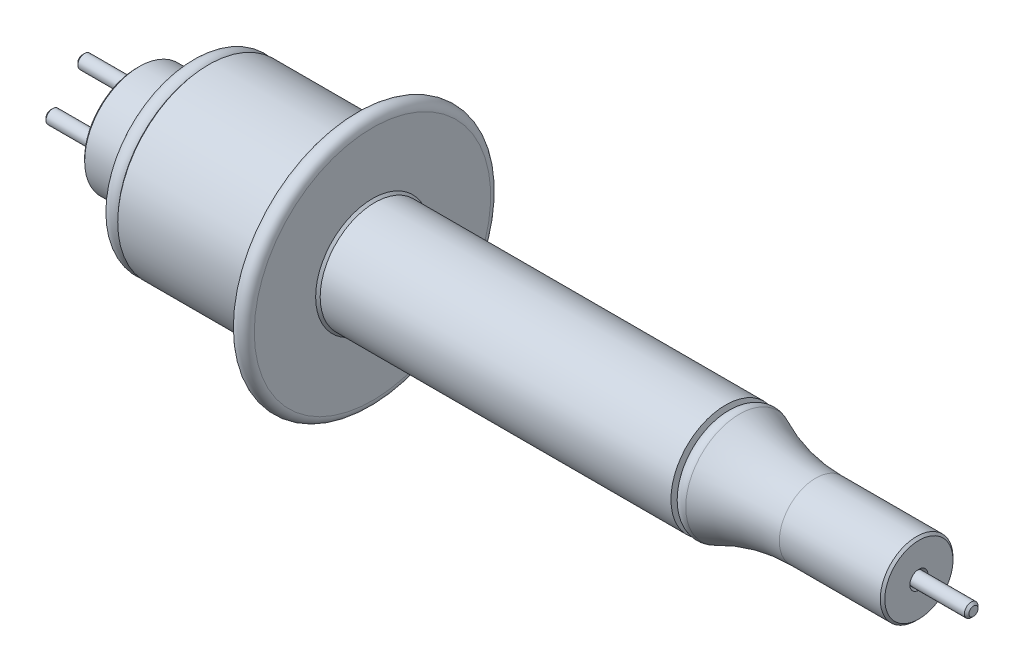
ISO-10303-21;
HEADER;
FILE_DESCRIPTION(('STEP AP214'),'2;1');
FILE_NAME('part.step','',(''),(''),'','','');
FILE_SCHEMA(('AUTOMOTIVE_DESIGN { 1 0 10303 214 1 1 1 1 }'));
ENDSEC;
DATA;
#1=APPLICATION_CONTEXT('core data for automotive mechanical design processes');
#2=APPLICATION_PROTOCOL_DEFINITION('international standard','automotive_design',2000,#1);
#3=PRODUCT_CONTEXT('',#1,'mechanical');
#4=PRODUCT('Part','Part','',(#3));
#5=PRODUCT_RELATED_PRODUCT_CATEGORY('part','',(#4));
#6=PRODUCT_DEFINITION_FORMATION('','',#4);
#7=PRODUCT_DEFINITION_CONTEXT('part definition',#1,'design');
#8=PRODUCT_DEFINITION('design','',#6,#7);
#9=PRODUCT_DEFINITION_SHAPE('','',#8);
#10=(LENGTH_UNIT() NAMED_UNIT(*) SI_UNIT(.MILLI.,.METRE.));
#11=(NAMED_UNIT(*) PLANE_ANGLE_UNIT() SI_UNIT($,.RADIAN.));
#12=(NAMED_UNIT(*) SI_UNIT($,.STERADIAN.) SOLID_ANGLE_UNIT());
#13=UNCERTAINTY_MEASURE_WITH_UNIT(LENGTH_MEASURE(1.E-05),#10,'distance_accuracy_value','');
#14=(GEOMETRIC_REPRESENTATION_CONTEXT(3) GLOBAL_UNCERTAINTY_ASSIGNED_CONTEXT((#13)) GLOBAL_UNIT_ASSIGNED_CONTEXT((#10,
#11,#12)) REPRESENTATION_CONTEXT('',''));
#15=CARTESIAN_POINT('',(0.,0.,0.));
#16=DIRECTION('',(0.,0.,1.));
#17=DIRECTION('',(1.,0.,0.));
#18=AXIS2_PLACEMENT_3D('',#15,#16,#17);
#19=CARTESIAN_POINT('',(-6.,3.5,0.));
#20=DIRECTION('',(1.,0.,0.));
#21=DIRECTION('',(0.,0.,-1.));
#22=AXIS2_PLACEMENT_3D('',#19,#20,#21);
#23=CYLINDRICAL_SURFACE('',#22,0.75);
#24=CARTESIAN_POINT('',(5.75,3.5,0.));
#25=DIRECTION('',(-1.,0.,0.));
#26=DIRECTION('',(0.,0.,1.));
#27=AXIS2_PLACEMENT_3D('',#24,#25,#26);
#28=CIRCLE('',#27,0.75);
#29=CARTESIAN_POINT('',(5.75,3.5,0.75));
#30=VERTEX_POINT('',#29);
#31=EDGE_CURVE('E53',#30,#30,#28,.T.);
#32=ORIENTED_EDGE('',*,*,#31,.T.);
#33=EDGE_LOOP('',(#32));
#34=FACE_BOUND('',#33,.T.);
#35=CARTESIAN_POINT('',(-5.75,3.5,0.));
#36=DIRECTION('',(-1.,0.,0.));
#37=DIRECTION('',(0.,0.,1.));
#38=AXIS2_PLACEMENT_3D('',#35,#36,#37);
#39=CIRCLE('',#38,0.75);
#40=CARTESIAN_POINT('',(-5.75,3.5,0.75));
#41=VERTEX_POINT('',#40);
#42=EDGE_CURVE('E57',#41,#41,#39,.F.);
#43=ORIENTED_EDGE('',*,*,#42,.T.);
#44=EDGE_LOOP('',(#43));
#45=FACE_BOUND('',#44,.T.);
#46=ADVANCED_FACE('F42',(#34,#45),#23,.T.);
#47=CARTESIAN_POINT('',(-6.,3.5,0.));
#48=DIRECTION('',(-1.,0.,0.));
#49=DIRECTION('',(0.,0.,1.));
#50=AXIS2_PLACEMENT_3D('',#47,#48,#49);
#51=PLANE('',#50);
#52=CARTESIAN_POINT('',(-6.,3.5,0.));
#53=DIRECTION('',(-1.,0.,0.));
#54=DIRECTION('',(0.,0.,1.));
#55=AXIS2_PLACEMENT_3D('',#52,#53,#54);
#56=CIRCLE('',#55,0.499999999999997);
#57=CARTESIAN_POINT('',(-6.,3.5,0.499999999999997));
#58=VERTEX_POINT('',#57);
#59=EDGE_CURVE('E11',#58,#58,#56,.T.);
#60=ORIENTED_EDGE('',*,*,#59,.T.);
#61=EDGE_LOOP('',(#60));
#62=FACE_BOUND('',#61,.T.);
#63=ADVANCED_FACE('F73',(#62),#51,.T.);
#64=CARTESIAN_POINT('',(6.,3.5,0.));
#65=DIRECTION('',(-1.,0.,0.));
#66=DIRECTION('',(0.,0.,1.));
#67=AXIS2_PLACEMENT_3D('',#64,#65,#66);
#68=PLANE('',#67);
#69=CARTESIAN_POINT('',(6.,3.5,0.));
#70=DIRECTION('',(-1.,0.,0.));
#71=DIRECTION('',(0.,0.,1.));
#72=AXIS2_PLACEMENT_3D('',#69,#70,#71);
#73=CIRCLE('',#72,0.499999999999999);
#74=CARTESIAN_POINT('',(6.,3.5,0.499999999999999));
#75=VERTEX_POINT('',#74);
#76=EDGE_CURVE('E49',#75,#75,#73,.F.);
#77=ORIENTED_EDGE('',*,*,#76,.T.);
#78=EDGE_LOOP('',(#77));
#79=FACE_BOUND('',#78,.T.);
#80=ADVANCED_FACE('F70',(#79),#68,.F.);
#81=CARTESIAN_POINT('',(5.75,3.5,0.));
#82=DIRECTION('',(-1.,0.,0.));
#83=DIRECTION('',(0.,0.,1.));
#84=AXIS2_PLACEMENT_3D('',#81,#82,#83);
#85=CONICAL_SURFACE('',#84,0.75,0.78539816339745);
#86=ORIENTED_EDGE('',*,*,#76,.F.);
#87=EDGE_LOOP('',(#86));
#88=FACE_BOUND('',#87,.T.);
#89=ORIENTED_EDGE('',*,*,#31,.F.);
#90=EDGE_LOOP('',(#89));
#91=FACE_BOUND('',#90,.T.);
#92=ADVANCED_FACE('F66',(#88,#91),#85,.T.);
#93=CARTESIAN_POINT('',(-6.,3.5,0.));
#94=DIRECTION('',(1.,0.,0.));
#95=DIRECTION('',(0.,0.,-1.));
#96=AXIS2_PLACEMENT_3D('',#93,#94,#95);
#97=CONICAL_SURFACE('',#96,0.499999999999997,0.785398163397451);
#98=ORIENTED_EDGE('',*,*,#42,.F.);
#99=EDGE_LOOP('',(#98));
#100=FACE_BOUND('',#99,.T.);
#101=ORIENTED_EDGE('',*,*,#59,.F.);
#102=EDGE_LOOP('',(#101));
#103=FACE_BOUND('',#102,.T.);
#104=ADVANCED_FACE('F44',(#100,#103),#97,.T.);
#105=CLOSED_SHELL('',(#46,#63,#80,#92,#104));
#106=MANIFOLD_SOLID_BREP('B2',#105);
#107=CARTESIAN_POINT('',(-6.,0.,3.5));
#108=DIRECTION('',(1.,0.,0.));
#109=DIRECTION('',(0.,0.,-1.));
#110=AXIS2_PLACEMENT_3D('',#107,#108,#109);
#111=CYLINDRICAL_SURFACE('',#110,0.75);
#112=CARTESIAN_POINT('',(5.75,0.,3.5));
#113=DIRECTION('',(-1.,0.,0.));
#114=DIRECTION('',(0.,0.,1.));
#115=AXIS2_PLACEMENT_3D('',#112,#113,#114);
#116=CIRCLE('',#115,0.75);
#117=CARTESIAN_POINT('',(5.75,0.,4.25));
#118=VERTEX_POINT('',#117);
#119=EDGE_CURVE('E132',#118,#118,#116,.T.);
#120=ORIENTED_EDGE('',*,*,#119,.T.);
#121=EDGE_LOOP('',(#120));
#122=FACE_BOUND('',#121,.T.);
#123=CARTESIAN_POINT('',(-5.75,0.,3.5));
#124=DIRECTION('',(-1.,0.,0.));
#125=DIRECTION('',(0.,0.,1.));
#126=AXIS2_PLACEMENT_3D('',#123,#124,#125);
#127=CIRCLE('',#126,0.75);
#128=CARTESIAN_POINT('',(-5.75,0.,4.25));
#129=VERTEX_POINT('',#128);
#130=EDGE_CURVE('E136',#129,#129,#127,.F.);
#131=ORIENTED_EDGE('',*,*,#130,.T.);
#132=EDGE_LOOP('',(#131));
#133=FACE_BOUND('',#132,.T.);
#134=ADVANCED_FACE('F121',(#122,#133),#111,.T.);
#135=CARTESIAN_POINT('',(-6.,0.,3.5));
#136=DIRECTION('',(-1.,0.,0.));
#137=DIRECTION('',(0.,0.,1.));
#138=AXIS2_PLACEMENT_3D('',#135,#136,#137);
#139=PLANE('',#138);
#140=CARTESIAN_POINT('',(-6.,0.,3.5));
#141=DIRECTION('',(-1.,0.,0.));
#142=DIRECTION('',(0.,0.,1.));
#143=AXIS2_PLACEMENT_3D('',#140,#141,#142);
#144=CIRCLE('',#143,0.500000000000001);
#145=CARTESIAN_POINT('',(-6.,0.,4.));
#146=VERTEX_POINT('',#145);
#147=EDGE_CURVE('E41',#146,#146,#144,.T.);
#148=ORIENTED_EDGE('',*,*,#147,.T.);
#149=EDGE_LOOP('',(#148));
#150=FACE_BOUND('',#149,.T.);
#151=ADVANCED_FACE('F152',(#150),#139,.T.);
#152=CARTESIAN_POINT('',(6.,0.,3.5));
#153=DIRECTION('',(-1.,0.,0.));
#154=DIRECTION('',(0.,0.,1.));
#155=AXIS2_PLACEMENT_3D('',#152,#153,#154);
#156=PLANE('',#155);
#157=CARTESIAN_POINT('',(6.,0.,3.5));
#158=DIRECTION('',(-1.,0.,0.));
#159=DIRECTION('',(0.,0.,1.));
#160=AXIS2_PLACEMENT_3D('',#157,#158,#159);
#161=CIRCLE('',#160,0.500000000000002);
#162=CARTESIAN_POINT('',(6.,0.,4.));
#163=VERTEX_POINT('',#162);
#164=EDGE_CURVE('E128',#163,#163,#161,.F.);
#165=ORIENTED_EDGE('',*,*,#164,.T.);
#166=EDGE_LOOP('',(#165));
#167=FACE_BOUND('',#166,.T.);
#168=ADVANCED_FACE('F149',(#167),#156,.F.);
#169=CARTESIAN_POINT('',(5.75,0.,3.5));
#170=DIRECTION('',(-1.,0.,0.));
#171=DIRECTION('',(0.,0.,1.));
#172=AXIS2_PLACEMENT_3D('',#169,#170,#171);
#173=CONICAL_SURFACE('',#172,0.75,0.78539816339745);
#174=ORIENTED_EDGE('',*,*,#164,.F.);
#175=EDGE_LOOP('',(#174));
#176=FACE_BOUND('',#175,.T.);
#177=ORIENTED_EDGE('',*,*,#119,.F.);
#178=EDGE_LOOP('',(#177));
#179=FACE_BOUND('',#178,.T.);
#180=ADVANCED_FACE('F145',(#176,#179),#173,.T.);
#181=CARTESIAN_POINT('',(-6.,0.,3.5));
#182=DIRECTION('',(1.,0.,0.));
#183=DIRECTION('',(0.,0.,-1.));
#184=AXIS2_PLACEMENT_3D('',#181,#182,#183);
#185=CONICAL_SURFACE('',#184,0.5,0.785398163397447);
#186=ORIENTED_EDGE('',*,*,#130,.F.);
#187=EDGE_LOOP('',(#186));
#188=FACE_BOUND('',#187,.T.);
#189=ORIENTED_EDGE('',*,*,#147,.F.);
#190=EDGE_LOOP('',(#189));
#191=FACE_BOUND('',#190,.T.);
#192=ADVANCED_FACE('F123',(#188,#191),#185,.T.);
#193=CLOSED_SHELL('',(#134,#151,#168,#180,#192));
#194=MANIFOLD_SOLID_BREP('B6',#193);
#195=CARTESIAN_POINT('',(-6.,-3.50000000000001,0.));
#196=DIRECTION('',(1.,0.,0.));
#197=DIRECTION('',(0.,0.,-1.));
#198=AXIS2_PLACEMENT_3D('',#195,#196,#197);
#199=CYLINDRICAL_SURFACE('',#198,0.750000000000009);
#200=CARTESIAN_POINT('',(5.75,-3.50000000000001,0.));
#201=DIRECTION('',(-1.,0.,0.));
#202=DIRECTION('',(0.,0.,1.));
#203=AXIS2_PLACEMENT_3D('',#200,#201,#202);
#204=CIRCLE('',#203,0.750000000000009);
#205=CARTESIAN_POINT('',(5.75,-3.50000000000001,0.749999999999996));
#206=VERTEX_POINT('',#205);
#207=EDGE_CURVE('E211',#206,#206,#204,.T.);
#208=ORIENTED_EDGE('',*,*,#207,.T.);
#209=EDGE_LOOP('',(#208));
#210=FACE_BOUND('',#209,.T.);
#211=CARTESIAN_POINT('',(-5.75,-3.50000000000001,0.));
#212=DIRECTION('',(-1.,0.,0.));
#213=DIRECTION('',(0.,0.,1.));
#214=AXIS2_PLACEMENT_3D('',#211,#212,#213);
#215=CIRCLE('',#214,0.750000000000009);
#216=CARTESIAN_POINT('',(-5.75,-3.50000000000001,0.749999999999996));
#217=VERTEX_POINT('',#216);
#218=EDGE_CURVE('E215',#217,#217,#215,.F.);
#219=ORIENTED_EDGE('',*,*,#218,.T.);
#220=EDGE_LOOP('',(#219));
#221=FACE_BOUND('',#220,.T.);
#222=ADVANCED_FACE('F200',(#210,#221),#199,.T.);
#223=CARTESIAN_POINT('',(-6.,-3.50000000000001,0.));
#224=DIRECTION('',(-1.,0.,0.));
#225=DIRECTION('',(0.,0.,1.));
#226=AXIS2_PLACEMENT_3D('',#223,#224,#225);
#227=PLANE('',#226);
#228=CARTESIAN_POINT('',(-6.,-3.50000000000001,0.));
#229=DIRECTION('',(-1.,0.,0.));
#230=DIRECTION('',(0.,0.,1.));
#231=AXIS2_PLACEMENT_3D('',#228,#229,#230);
#232=CIRCLE('',#231,0.500000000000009);
#233=CARTESIAN_POINT('',(-6.,-3.50000000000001,0.499999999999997));
#234=VERTEX_POINT('',#233);
#235=EDGE_CURVE('E120',#234,#234,#232,.T.);
#236=ORIENTED_EDGE('',*,*,#235,.T.);
#237=EDGE_LOOP('',(#236));
#238=FACE_BOUND('',#237,.T.);
#239=ADVANCED_FACE('F231',(#238),#227,.T.);
#240=CARTESIAN_POINT('',(6.,-3.50000000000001,0.));
#241=DIRECTION('',(-1.,0.,0.));
#242=DIRECTION('',(0.,0.,1.));
#243=AXIS2_PLACEMENT_3D('',#240,#241,#242);
#244=PLANE('',#243);
#245=CARTESIAN_POINT('',(6.,-3.50000000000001,0.));
#246=DIRECTION('',(-1.,0.,0.));
#247=DIRECTION('',(0.,0.,1.));
#248=AXIS2_PLACEMENT_3D('',#245,#246,#247);
#249=CIRCLE('',#248,0.500000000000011);
#250=CARTESIAN_POINT('',(6.,-3.50000000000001,0.499999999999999));
#251=VERTEX_POINT('',#250);
#252=EDGE_CURVE('E207',#251,#251,#249,.F.);
#253=ORIENTED_EDGE('',*,*,#252,.T.);
#254=EDGE_LOOP('',(#253));
#255=FACE_BOUND('',#254,.T.);
#256=ADVANCED_FACE('F228',(#255),#244,.F.);
#257=CARTESIAN_POINT('',(5.75,-3.50000000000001,0.));
#258=DIRECTION('',(-1.,0.,0.));
#259=DIRECTION('',(0.,0.,1.));
#260=AXIS2_PLACEMENT_3D('',#257,#258,#259);
#261=CONICAL_SURFACE('',#260,0.750000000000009,0.785398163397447);
#262=ORIENTED_EDGE('',*,*,#252,.F.);
#263=EDGE_LOOP('',(#262));
#264=FACE_BOUND('',#263,.T.);
#265=ORIENTED_EDGE('',*,*,#207,.F.);
#266=EDGE_LOOP('',(#265));
#267=FACE_BOUND('',#266,.T.);
#268=ADVANCED_FACE('F224',(#264,#267),#261,.T.);
#269=CARTESIAN_POINT('',(-6.,-3.50000000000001,0.));
#270=DIRECTION('',(1.,0.,0.));
#271=DIRECTION('',(0.,0.,-1.));
#272=AXIS2_PLACEMENT_3D('',#269,#270,#271);
#273=CONICAL_SURFACE('',#272,0.500000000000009,0.785398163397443);
#274=ORIENTED_EDGE('',*,*,#218,.F.);
#275=EDGE_LOOP('',(#274));
#276=FACE_BOUND('',#275,.T.);
#277=ORIENTED_EDGE('',*,*,#235,.F.);
#278=EDGE_LOOP('',(#277));
#279=FACE_BOUND('',#278,.T.);
#280=ADVANCED_FACE('F202',(#276,#279),#273,.T.);
#281=CLOSED_SHELL('',(#222,#239,#256,#268,#280));
#282=MANIFOLD_SOLID_BREP('B36',#281);
#283=CARTESIAN_POINT('',(-6.,0.,-3.49999999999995));
#284=DIRECTION('',(1.,0.,0.));
#285=DIRECTION('',(0.,0.,-1.));
#286=AXIS2_PLACEMENT_3D('',#283,#284,#285);
#287=CYLINDRICAL_SURFACE('',#286,0.750000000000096);
#288=CARTESIAN_POINT('',(5.75,0.,-3.49999999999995));
#289=DIRECTION('',(-1.,0.,0.));
#290=DIRECTION('',(0.,0.,1.));
#291=AXIS2_PLACEMENT_3D('',#288,#289,#290);
#292=CIRCLE('',#291,0.750000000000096);
#293=CARTESIAN_POINT('',(5.75,0.,-2.74999999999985));
#294=VERTEX_POINT('',#293);
#295=EDGE_CURVE('E290',#294,#294,#292,.T.);
#296=ORIENTED_EDGE('',*,*,#295,.T.);
#297=EDGE_LOOP('',(#296));
#298=FACE_BOUND('',#297,.T.);
#299=CARTESIAN_POINT('',(-5.75,0.,-3.49999999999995));
#300=DIRECTION('',(-1.,0.,0.));
#301=DIRECTION('',(0.,0.,1.));
#302=AXIS2_PLACEMENT_3D('',#299,#300,#301);
#303=CIRCLE('',#302,0.750000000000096);
#304=CARTESIAN_POINT('',(-5.75,0.,-2.74999999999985));
#305=VERTEX_POINT('',#304);
#306=EDGE_CURVE('E294',#305,#305,#303,.F.);
#307=ORIENTED_EDGE('',*,*,#306,.T.);
#308=EDGE_LOOP('',(#307));
#309=FACE_BOUND('',#308,.T.);
#310=ADVANCED_FACE('F279',(#298,#309),#287,.T.);
#311=CARTESIAN_POINT('',(-6.,0.,-3.49999999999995));
#312=DIRECTION('',(-1.,0.,0.));
#313=DIRECTION('',(0.,0.,1.));
#314=AXIS2_PLACEMENT_3D('',#311,#312,#313);
#315=PLANE('',#314);
#316=CARTESIAN_POINT('',(-6.,0.,-3.49999999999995));
#317=DIRECTION('',(-1.,0.,0.));
#318=DIRECTION('',(0.,0.,1.));
#319=AXIS2_PLACEMENT_3D('',#316,#317,#318);
#320=CIRCLE('',#319,0.500000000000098);
#321=CARTESIAN_POINT('',(-6.,0.,-2.99999999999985));
#322=VERTEX_POINT('',#321);
#323=EDGE_CURVE('E199',#322,#322,#320,.T.);
#324=ORIENTED_EDGE('',*,*,#323,.T.);
#325=EDGE_LOOP('',(#324));
#326=FACE_BOUND('',#325,.T.);
#327=ADVANCED_FACE('F310',(#326),#315,.T.);
#328=CARTESIAN_POINT('',(6.,0.,-3.49999999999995));
#329=DIRECTION('',(-1.,0.,0.));
#330=DIRECTION('',(0.,0.,1.));
#331=AXIS2_PLACEMENT_3D('',#328,#329,#330);
#332=PLANE('',#331);
#333=CARTESIAN_POINT('',(6.,0.,-3.49999999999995));
#334=DIRECTION('',(-1.,0.,0.));
#335=DIRECTION('',(0.,0.,1.));
#336=AXIS2_PLACEMENT_3D('',#333,#334,#335);
#337=CIRCLE('',#336,0.500000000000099);
#338=CARTESIAN_POINT('',(6.,0.,-2.99999999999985));
#339=VERTEX_POINT('',#338);
#340=EDGE_CURVE('E286',#339,#339,#337,.F.);
#341=ORIENTED_EDGE('',*,*,#340,.T.);
#342=EDGE_LOOP('',(#341));
#343=FACE_BOUND('',#342,.T.);
#344=ADVANCED_FACE('F307',(#343),#332,.F.);
#345=CARTESIAN_POINT('',(5.75,0.,-3.49999999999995));
#346=DIRECTION('',(-1.,0.,0.));
#347=DIRECTION('',(0.,0.,1.));
#348=AXIS2_PLACEMENT_3D('',#345,#346,#347);
#349=CONICAL_SURFACE('',#348,0.750000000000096,0.785398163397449);
#350=ORIENTED_EDGE('',*,*,#340,.F.);
#351=EDGE_LOOP('',(#350));
#352=FACE_BOUND('',#351,.T.);
#353=ORIENTED_EDGE('',*,*,#295,.F.);
#354=EDGE_LOOP('',(#353));
#355=FACE_BOUND('',#354,.T.);
#356=ADVANCED_FACE('F303',(#352,#355),#349,.T.);
#357=CARTESIAN_POINT('',(-6.,0.,-3.49999999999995));
#358=DIRECTION('',(1.,0.,0.));
#359=DIRECTION('',(0.,0.,-1.));
#360=AXIS2_PLACEMENT_3D('',#357,#358,#359);
#361=CONICAL_SURFACE('',#360,0.500000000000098,0.785398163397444);
#362=ORIENTED_EDGE('',*,*,#306,.F.);
#363=EDGE_LOOP('',(#362));
#364=FACE_BOUND('',#363,.T.);
#365=ORIENTED_EDGE('',*,*,#323,.F.);
#366=EDGE_LOOP('',(#365));
#367=FACE_BOUND('',#366,.T.);
#368=ADVANCED_FACE('F281',(#364,#367),#361,.T.);
#369=CLOSED_SHELL('',(#310,#327,#344,#356,#368));
#370=MANIFOLD_SOLID_BREP('B115',#369);
#371=CARTESIAN_POINT('',(92.,0.,0.));
#372=DIRECTION('',(-1.,0.,0.));
#373=DIRECTION('',(0.,0.,1.));
#374=AXIS2_PLACEMENT_3D('',#371,#372,#373);
#375=CYLINDRICAL_SURFACE('',#374,0.75);
#376=CARTESIAN_POINT('',(80.25,0.,0.));
#377=DIRECTION('',(1.,0.,0.));
#378=DIRECTION('',(0.,0.,-1.));
#379=AXIS2_PLACEMENT_3D('',#376,#377,#378);
#380=CIRCLE('',#379,0.75);
#381=CARTESIAN_POINT('',(80.25,0.,-0.75));
#382=VERTEX_POINT('',#381);
#383=EDGE_CURVE('E368',#382,#382,#380,.T.);
#384=ORIENTED_EDGE('',*,*,#383,.T.);
#385=EDGE_LOOP('',(#384));
#386=FACE_BOUND('',#385,.T.);
#387=CARTESIAN_POINT('',(91.75,0.,0.));
#388=DIRECTION('',(1.,0.,0.));
#389=DIRECTION('',(0.,0.,-1.));
#390=AXIS2_PLACEMENT_3D('',#387,#388,#389);
#391=CIRCLE('',#390,0.75);
#392=CARTESIAN_POINT('',(91.75,0.,-0.75));
#393=VERTEX_POINT('',#392);
#394=EDGE_CURVE('E372',#393,#393,#391,.F.);
#395=ORIENTED_EDGE('',*,*,#394,.T.);
#396=EDGE_LOOP('',(#395));
#397=FACE_BOUND('',#396,.T.);
#398=ADVANCED_FACE('F357',(#386,#397),#375,.T.);
#399=CARTESIAN_POINT('',(92.,0.,0.));
#400=DIRECTION('',(1.,0.,0.));
#401=DIRECTION('',(0.,0.,-1.));
#402=AXIS2_PLACEMENT_3D('',#399,#400,#401);
#403=PLANE('',#402);
#404=CARTESIAN_POINT('',(92.,0.,0.));
#405=DIRECTION('',(1.,0.,0.));
#406=DIRECTION('',(0.,0.,-1.));
#407=AXIS2_PLACEMENT_3D('',#404,#405,#406);
#408=CIRCLE('',#407,0.500000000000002);
#409=CARTESIAN_POINT('',(92.,0.,-0.500000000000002));
#410=VERTEX_POINT('',#409);
#411=EDGE_CURVE('E278',#410,#410,#408,.T.);
#412=ORIENTED_EDGE('',*,*,#411,.T.);
#413=EDGE_LOOP('',(#412));
#414=FACE_BOUND('',#413,.T.);
#415=ADVANCED_FACE('F388',(#414),#403,.T.);
#416=CARTESIAN_POINT('',(80.,0.,0.));
#417=DIRECTION('',(1.,0.,0.));
#418=DIRECTION('',(0.,0.,-1.));
#419=AXIS2_PLACEMENT_3D('',#416,#417,#418);
#420=PLANE('',#419);
#421=CARTESIAN_POINT('',(80.,0.,0.));
#422=DIRECTION('',(1.,0.,0.));
#423=DIRECTION('',(0.,0.,-1.));
#424=AXIS2_PLACEMENT_3D('',#421,#422,#423);
#425=CIRCLE('',#424,0.499999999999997);
#426=CARTESIAN_POINT('',(80.,0.,-0.499999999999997));
#427=VERTEX_POINT('',#426);
#428=EDGE_CURVE('E364',#427,#427,#425,.F.);
#429=ORIENTED_EDGE('',*,*,#428,.T.);
#430=EDGE_LOOP('',(#429));
#431=FACE_BOUND('',#430,.T.);
#432=ADVANCED_FACE('F385',(#431),#420,.F.);
#433=CARTESIAN_POINT('',(80.25,0.,0.));
#434=DIRECTION('',(1.,0.,0.));
#435=DIRECTION('',(0.,0.,-1.));
#436=AXIS2_PLACEMENT_3D('',#433,#434,#435);
#437=CONICAL_SURFACE('',#436,0.75,0.785398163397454);
#438=ORIENTED_EDGE('',*,*,#428,.F.);
#439=EDGE_LOOP('',(#438));
#440=FACE_BOUND('',#439,.T.);
#441=ORIENTED_EDGE('',*,*,#383,.F.);
#442=EDGE_LOOP('',(#441));
#443=FACE_BOUND('',#442,.T.);
#444=ADVANCED_FACE('F381',(#440,#443),#437,.T.);
#445=CARTESIAN_POINT('',(92.,0.,0.));
#446=DIRECTION('',(-1.,0.,0.));
#447=DIRECTION('',(0.,0.,1.));
#448=AXIS2_PLACEMENT_3D('',#445,#446,#447);
#449=CONICAL_SURFACE('',#448,0.500000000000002,0.785398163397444);
#450=ORIENTED_EDGE('',*,*,#394,.F.);
#451=EDGE_LOOP('',(#450));
#452=FACE_BOUND('',#451,.T.);
#453=ORIENTED_EDGE('',*,*,#411,.F.);
#454=EDGE_LOOP('',(#453));
#455=FACE_BOUND('',#454,.T.);
#456=ADVANCED_FACE('F359',(#452,#455),#449,.T.);
#457=CLOSED_SHELL('',(#398,#415,#432,#444,#456));
#458=MANIFOLD_SOLID_BREP('B194',#457);
#459=CARTESIAN_POINT('',(80.,0.,0.));
#460=DIRECTION('',(-1.,0.,0.));
#461=DIRECTION('',(0.,0.,1.));
#462=AXIS2_PLACEMENT_3D('',#459,#460,#461);
#463=PLANE('',#462);
#464=CARTESIAN_POINT('',(80.,0.,0.));
#465=DIRECTION('',(-1.,0.,0.));
#466=DIRECTION('',(0.,0.,1.));
#467=AXIS2_PLACEMENT_3D('',#464,#465,#466);
#468=CIRCLE('',#467,0.499999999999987);
#469=CARTESIAN_POINT('',(80.,0.,0.499999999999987));
#470=VERTEX_POINT('',#469);
#471=EDGE_CURVE('E504',#470,#470,#468,.F.);
#472=ORIENTED_EDGE('',*,*,#471,.T.);
#473=EDGE_LOOP('',(#472));
#474=FACE_BOUND('',#473,.T.);
#475=ADVANCED_FACE('F427',(#474),#463,.F.);
#476=CARTESIAN_POINT('',(0.,0.,0.));
#477=DIRECTION('',(-1.,0.,0.));
#478=DIRECTION('',(0.,0.,1.));
#479=AXIS2_PLACEMENT_3D('',#476,#477,#478);
#480=CYLINDRICAL_SURFACE('',#479,0.75);
#481=CARTESIAN_POINT('',(80.25,0.,0.));
#482=DIRECTION('',(-1.,0.,0.));
#483=DIRECTION('',(0.,0.,1.));
#484=AXIS2_PLACEMENT_3D('',#481,#482,#483);
#485=CIRCLE('',#484,0.75);
#486=CARTESIAN_POINT('',(80.25,0.,0.75));
#487=VERTEX_POINT('',#486);
#488=EDGE_CURVE('E507',#487,#487,#485,.T.);
#489=ORIENTED_EDGE('',*,*,#488,.T.);
#490=EDGE_LOOP('',(#489));
#491=FACE_BOUND('',#490,.T.);
#492=CARTESIAN_POINT('',(85.75,0.,0.));
#493=DIRECTION('',(-1.,0.,0.));
#494=DIRECTION('',(0.,0.,1.));
#495=AXIS2_PLACEMENT_3D('',#492,#493,#494);
#496=CIRCLE('',#495,0.75);
#497=CARTESIAN_POINT('',(85.75,0.,0.75));
#498=VERTEX_POINT('',#497);
#499=EDGE_CURVE('E510',#498,#498,#496,.F.);
#500=ORIENTED_EDGE('',*,*,#499,.T.);
#501=EDGE_LOOP('',(#500));
#502=FACE_BOUND('',#501,.T.);
#503=ADVANCED_FACE('F616',(#491,#502),#480,.F.);
#504=CARTESIAN_POINT('',(86.,0.75,0.));
#505=DIRECTION('',(-1.,0.,0.));
#506=DIRECTION('',(0.,0.,1.));
#507=AXIS2_PLACEMENT_3D('',#504,#505,#506);
#508=PLANE('',#507);
#509=CARTESIAN_POINT('',(86.,0.,0.));
#510=DIRECTION('',(-1.,0.,0.));
#511=DIRECTION('',(0.,0.,1.));
#512=AXIS2_PLACEMENT_3D('',#509,#510,#511);
#513=CIRCLE('',#512,1.);
#514=CARTESIAN_POINT('',(86.,0.,1.));
#515=VERTEX_POINT('',#514);
#516=EDGE_CURVE('E498',#515,#515,#513,.T.);
#517=ORIENTED_EDGE('',*,*,#516,.T.);
#518=EDGE_LOOP('',(#517));
#519=FACE_BOUND('',#518,.T.);
#520=CARTESIAN_POINT('',(86.,0.,0.));
#521=DIRECTION('',(-1.,0.,0.));
#522=DIRECTION('',(0.,0.,1.));
#523=AXIS2_PLACEMENT_3D('',#520,#521,#522);
#524=CIRCLE('',#523,3.75000000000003);
#525=CARTESIAN_POINT('',(86.,0.,3.75000000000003));
#526=VERTEX_POINT('',#525);
#527=EDGE_CURVE('E501',#526,#526,#524,.F.);
#528=ORIENTED_EDGE('',*,*,#527,.T.);
#529=EDGE_LOOP('',(#528));
#530=FACE_BOUND('',#529,.T.);
#531=ADVANCED_FACE('F623',(#519,#530),#508,.F.);
#532=CARTESIAN_POINT('',(0.,0.,0.));
#533=DIRECTION('',(-1.,0.,0.));
#534=DIRECTION('',(0.,0.,1.));
#535=AXIS2_PLACEMENT_3D('',#532,#533,#534);
#536=CYLINDRICAL_SURFACE('',#535,4.);
#537=CARTESIAN_POINT('',(85.75,0.,0.));
#538=DIRECTION('',(-1.,0.,0.));
#539=DIRECTION('',(0.,0.,1.));
#540=AXIS2_PLACEMENT_3D('',#537,#538,#539);
#541=CIRCLE('',#540,4.);
#542=CARTESIAN_POINT('',(85.75,0.,4.));
#543=VERTEX_POINT('',#542);
#544=EDGE_CURVE('E483',#543,#543,#541,.T.);
#545=ORIENTED_EDGE('',*,*,#544,.T.);
#546=EDGE_LOOP('',(#545));
#547=FACE_BOUND('',#546,.T.);
#548=CARTESIAN_POINT('',(74.65,0.,0.));
#549=DIRECTION('',(-1.,0.,0.));
#550=DIRECTION('',(0.,0.,1.));
#551=AXIS2_PLACEMENT_3D('',#548,#549,#550);
#552=CIRCLE('',#551,4.);
#553=CARTESIAN_POINT('',(74.65,0.,4.));
#554=VERTEX_POINT('',#553);
#555=EDGE_CURVE('E513',#554,#554,#552,.T.);
#556=ORIENTED_EDGE('',*,*,#555,.F.);
#557=EDGE_LOOP('',(#556));
#558=FACE_BOUND('',#557,.T.);
#559=ADVANCED_FACE('F919',(#547,#558),#536,.T.);
#560=CARTESIAN_POINT('',(74.65,0.,0.));
#561=DIRECTION('',(-1.,0.,0.));
#562=DIRECTION('',(0.,0.,1.));
#563=AXIS2_PLACEMENT_3D('',#560,#561,#562);
#564=TOROIDAL_SURFACE('',#563,23.4481,19.4481);
#565=CARTESIAN_POINT('',(66.2613359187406,0.,0.));
#566=DIRECTION('',(-1.,0.,0.));
#567=DIRECTION('',(0.,0.,1.));
#568=AXIS2_PLACEMENT_3D('',#565,#566,#567);
#569=CIRCLE('',#568,5.90219140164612);
#570=CARTESIAN_POINT('',(66.2613359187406,0.,5.90219140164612));
#571=VERTEX_POINT('',#570);
#572=EDGE_CURVE('E516',#571,#571,#569,.T.);
#573=ORIENTED_EDGE('',*,*,#572,.F.);
#574=EDGE_LOOP('',(#573));
#575=FACE_BOUND('',#574,.T.);
#576=ORIENTED_EDGE('',*,*,#555,.T.);
#577=EDGE_LOOP('',(#576));
#578=FACE_BOUND('',#577,.T.);
#579=ADVANCED_FACE('F910',(#575,#578),#564,.F.);
#580=CARTESIAN_POINT('',(65.83,0.,0.));
#581=DIRECTION('',(-1.,0.,0.));
#582=DIRECTION('',(0.,0.,1.));
#583=AXIS2_PLACEMENT_3D('',#580,#581,#582);
#584=TOROIDAL_SURFACE('',#583,5.,1.);
#585=CARTESIAN_POINT('',(64.9227461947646,0.,0.));
#586=DIRECTION('',(-1.,0.,0.));
#587=DIRECTION('',(0.,0.,1.));
#588=AXIS2_PLACEMENT_3D('',#585,#586,#587);
#589=CIRCLE('',#588,5.42058356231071);
#590=CARTESIAN_POINT('',(64.9227461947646,0.,5.42058356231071));
#591=VERTEX_POINT('',#590);
#592=EDGE_CURVE('E519',#591,#591,#589,.T.);
#593=ORIENTED_EDGE('',*,*,#592,.F.);
#594=EDGE_LOOP('',(#593));
#595=FACE_BOUND('',#594,.T.);
#596=ORIENTED_EDGE('',*,*,#572,.T.);
#597=EDGE_LOOP('',(#596));
#598=FACE_BOUND('',#597,.T.);
#599=ADVANCED_FACE('F901',(#595,#598),#584,.T.);
#600=CARTESIAN_POINT('',(64.9227461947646,0.,0.));
#601=DIRECTION('',(-1.,0.,0.));
#602=DIRECTION('',(0.,0.,1.));
#603=AXIS2_PLACEMENT_3D('',#600,#601,#602);
#604=CONICAL_SURFACE('',#603,5.42058356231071,1.24965574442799);
#605=CARTESIAN_POINT('',(64.73,0.,0.));
#606=DIRECTION('',(-1.,0.,0.));
#607=DIRECTION('',(0.,0.,1.));
#608=AXIS2_PLACEMENT_3D('',#605,#606,#607);
#609=CIRCLE('',#608,6.);
#610=CARTESIAN_POINT('',(64.73,0.,6.));
#611=VERTEX_POINT('',#610);
#612=EDGE_CURVE('E522',#611,#611,#609,.T.);
#613=ORIENTED_EDGE('',*,*,#612,.F.);
#614=EDGE_LOOP('',(#613));
#615=FACE_BOUND('',#614,.T.);
#616=ORIENTED_EDGE('',*,*,#592,.T.);
#617=EDGE_LOOP('',(#616));
#618=FACE_BOUND('',#617,.T.);
#619=ADVANCED_FACE('F612',(#615,#618),#604,.T.);
#620=CARTESIAN_POINT('',(0.,0.,0.));
#621=DIRECTION('',(-1.,0.,0.));
#622=DIRECTION('',(0.,0.,1.));
#623=AXIS2_PLACEMENT_3D('',#620,#621,#622);
#624=CYLINDRICAL_SURFACE('',#623,6.);
#625=CARTESIAN_POINT('',(26.1540934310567,0.,0.));
#626=DIRECTION('',(-1.,0.,0.));
#627=DIRECTION('',(0.,0.,1.));
#628=AXIS2_PLACEMENT_3D('',#625,#626,#627);
#629=CIRCLE('',#628,6.);
#630=CARTESIAN_POINT('',(26.1540934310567,0.,6.));
#631=VERTEX_POINT('',#630);
#632=EDGE_CURVE('E486',#631,#631,#629,.F.);
#633=ORIENTED_EDGE('',*,*,#632,.T.);
#634=EDGE_LOOP('',(#633));
#635=FACE_BOUND('',#634,.T.);
#636=ORIENTED_EDGE('',*,*,#612,.T.);
#637=EDGE_LOOP('',(#636));
#638=FACE_BOUND('',#637,.T.);
#639=ADVANCED_FACE('F605',(#635,#638),#624,.T.);
#640=CARTESIAN_POINT('',(25.9040934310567,6.,0.));
#641=DIRECTION('',(-1.,0.,0.));
#642=DIRECTION('',(0.,0.,1.));
#643=AXIS2_PLACEMENT_3D('',#640,#641,#642);
#644=PLANE('',#643);
#645=CARTESIAN_POINT('',(25.9040934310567,0.,0.));
#646=DIRECTION('',(-1.,0.,0.));
#647=DIRECTION('',(0.,0.,1.));
#648=AXIS2_PLACEMENT_3D('',#645,#646,#647);
#649=CIRCLE('',#648,6.24999999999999);
#650=CARTESIAN_POINT('',(25.9040934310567,0.,6.24999999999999));
#651=VERTEX_POINT('',#650);
#652=EDGE_CURVE('E489',#651,#651,#649,.T.);
#653=ORIENTED_EDGE('',*,*,#652,.T.);
#654=EDGE_LOOP('',(#653));
#655=FACE_BOUND('',#654,.T.);
#656=CARTESIAN_POINT('',(25.9040934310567,0.,0.));
#657=DIRECTION('',(-1.,0.,0.));
#658=DIRECTION('',(0.,0.,1.));
#659=AXIS2_PLACEMENT_3D('',#656,#657,#658);
#660=CIRCLE('',#659,13.);
#661=CARTESIAN_POINT('',(25.9040934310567,0.,13.));
#662=VERTEX_POINT('',#661);
#663=EDGE_CURVE('E525',#662,#662,#660,.T.);
#664=ORIENTED_EDGE('',*,*,#663,.F.);
#665=EDGE_LOOP('',(#664));
#666=FACE_BOUND('',#665,.T.);
#667=ADVANCED_FACE('F600',(#655,#666),#644,.F.);
#668=CARTESIAN_POINT('',(24.9515934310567,0.,0.));
#669=DIRECTION('',(-1.,0.,0.));
#670=DIRECTION('',(0.,0.,1.));
#671=AXIS2_PLACEMENT_3D('',#668,#669,#670);
#672=TOROIDAL_SURFACE('',#671,13.,0.952500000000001);
#673=CARTESIAN_POINT('',(24.,0.,0.));
#674=DIRECTION('',(-1.,0.,0.));
#675=DIRECTION('',(0.,0.,1.));
#676=AXIS2_PLACEMENT_3D('',#673,#674,#675);
#677=CIRCLE('',#676,13.0415474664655);
#678=CARTESIAN_POINT('',(24.,0.,13.0415474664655));
#679=VERTEX_POINT('',#678);
#680=EDGE_CURVE('E528',#679,#679,#677,.T.);
#681=ORIENTED_EDGE('',*,*,#680,.F.);
#682=EDGE_LOOP('',(#681));
#683=FACE_BOUND('',#682,.T.);
#684=ORIENTED_EDGE('',*,*,#663,.T.);
#685=EDGE_LOOP('',(#684));
#686=FACE_BOUND('',#685,.T.);
#687=ADVANCED_FACE('F594',(#683,#686),#672,.T.);
#688=CARTESIAN_POINT('',(24.,0.,0.));
#689=DIRECTION('',(1.,0.,0.));
#690=DIRECTION('',(0.,0.,-1.));
#691=AXIS2_PLACEMENT_3D('',#688,#689,#690);
#692=CONICAL_SURFACE('',#691,13.0415474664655,1.52716309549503);
#693=CARTESIAN_POINT('',(23.8467681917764,0.,0.));
#694=DIRECTION('',(-1.,0.,0.));
#695=DIRECTION('',(0.,0.,1.));
#696=AXIS2_PLACEMENT_3D('',#693,#694,#695);
#697=CIRCLE('',#696,9.53196205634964);
#698=CARTESIAN_POINT('',(23.8467681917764,0.,9.53196205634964));
#699=VERTEX_POINT('',#698);
#700=EDGE_CURVE('E531',#699,#699,#697,.T.);
#701=ORIENTED_EDGE('',*,*,#700,.F.);
#702=EDGE_LOOP('',(#701));
#703=FACE_BOUND('',#702,.T.);
#704=ORIENTED_EDGE('',*,*,#680,.T.);
#705=EDGE_LOOP('',(#704));
#706=FACE_BOUND('',#705,.T.);
#707=ADVANCED_FACE('F588',(#703,#706),#692,.T.);
#708=CARTESIAN_POINT('',(23.,0.,0.));
#709=DIRECTION('',(-1.,0.,0.));
#710=DIRECTION('',(0.,0.,1.));
#711=AXIS2_PLACEMENT_3D('',#708,#709,#710);
#712=TOROIDAL_SURFACE('',#711,9.,0.999999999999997);
#713=CARTESIAN_POINT('',(22.3362166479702,0.,0.));
#714=DIRECTION('',(-1.,0.,0.));
#715=DIRECTION('',(0.,0.,1.));
#716=AXIS2_PLACEMENT_3D('',#713,#714,#715);
#717=CIRCLE('',#716,9.74792490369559);
#718=CARTESIAN_POINT('',(22.3362166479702,0.,9.74792490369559));
#719=VERTEX_POINT('',#718);
#720=EDGE_CURVE('E534',#719,#719,#717,.T.);
#721=ORIENTED_EDGE('',*,*,#720,.F.);
#722=EDGE_LOOP('',(#721));
#723=FACE_BOUND('',#722,.T.);
#724=ORIENTED_EDGE('',*,*,#700,.T.);
#725=EDGE_LOOP('',(#724));
#726=FACE_BOUND('',#725,.T.);
#727=ADVANCED_FACE('F582',(#723,#726),#712,.T.);
#728=CARTESIAN_POINT('',(22.3362166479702,0.,0.));
#729=DIRECTION('',(-1.,0.,0.));
#730=DIRECTION('',(0.,0.,1.));
#731=AXIS2_PLACEMENT_3D('',#728,#729,#730);
#732=CONICAL_SURFACE('',#731,9.74792490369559,0.844930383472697);
#733=CARTESIAN_POINT('',(22.1125,0.,0.));
#734=DIRECTION('',(-1.,0.,0.));
#735=DIRECTION('',(0.,0.,1.));
#736=AXIS2_PLACEMENT_3D('',#733,#734,#735);
#737=CIRCLE('',#736,10.);
#738=CARTESIAN_POINT('',(22.1125,0.,10.));
#739=VERTEX_POINT('',#738);
#740=EDGE_CURVE('E537',#739,#739,#737,.T.);
#741=ORIENTED_EDGE('',*,*,#740,.F.);
#742=EDGE_LOOP('',(#741));
#743=FACE_BOUND('',#742,.T.);
#744=ORIENTED_EDGE('',*,*,#720,.T.);
#745=EDGE_LOOP('',(#744));
#746=FACE_BOUND('',#745,.T.);
#747=ADVANCED_FACE('F576',(#743,#746),#732,.T.);
#748=CARTESIAN_POINT('',(0.,0.,0.));
#749=DIRECTION('',(-1.,0.,0.));
#750=DIRECTION('',(0.,0.,1.));
#751=AXIS2_PLACEMENT_3D('',#748,#749,#750);
#752=CYLINDRICAL_SURFACE('',#751,10.);
#753=CARTESIAN_POINT('',(7.88750000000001,0.,0.));
#754=DIRECTION('',(-1.,0.,0.));
#755=DIRECTION('',(0.,0.,1.));
#756=AXIS2_PLACEMENT_3D('',#753,#754,#755);
#757=CIRCLE('',#756,10.);
#758=CARTESIAN_POINT('',(7.88750000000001,0.,10.));
#759=VERTEX_POINT('',#758);
#760=EDGE_CURVE('E540',#759,#759,#757,.T.);
#761=ORIENTED_EDGE('',*,*,#760,.F.);
#762=EDGE_LOOP('',(#761));
#763=FACE_BOUND('',#762,.T.);
#764=ORIENTED_EDGE('',*,*,#740,.T.);
#765=EDGE_LOOP('',(#764));
#766=FACE_BOUND('',#765,.T.);
#767=ADVANCED_FACE('F570',(#763,#766),#752,.T.);
#768=CARTESIAN_POINT('',(7.88750000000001,0.,0.));
#769=DIRECTION('',(1.,0.,0.));
#770=DIRECTION('',(0.,0.,-1.));
#771=AXIS2_PLACEMENT_3D('',#768,#769,#770);
#772=CONICAL_SURFACE('',#771,10.,0.844930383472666);
#773=CARTESIAN_POINT('',(7.66378335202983,0.,0.));
#774=DIRECTION('',(-1.,0.,0.));
#775=DIRECTION('',(0.,0.,1.));
#776=AXIS2_PLACEMENT_3D('',#773,#774,#775);
#777=CIRCLE('',#776,9.74792490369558);
#778=CARTESIAN_POINT('',(7.66378335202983,0.,9.74792490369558));
#779=VERTEX_POINT('',#778);
#780=EDGE_CURVE('E543',#779,#779,#777,.T.);
#781=ORIENTED_EDGE('',*,*,#780,.F.);
#782=EDGE_LOOP('',(#781));
#783=FACE_BOUND('',#782,.T.);
#784=ORIENTED_EDGE('',*,*,#760,.T.);
#785=EDGE_LOOP('',(#784));
#786=FACE_BOUND('',#785,.T.);
#787=ADVANCED_FACE('F564',(#783,#786),#772,.T.);
#788=CARTESIAN_POINT('',(7.,0.,0.));
#789=DIRECTION('',(-1.,0.,0.));
#790=DIRECTION('',(0.,0.,1.));
#791=AXIS2_PLACEMENT_3D('',#788,#789,#790);
#792=TOROIDAL_SURFACE('',#791,9.,1.);
#793=CARTESIAN_POINT('',(6.,0.,0.));
#794=DIRECTION('',(-1.,0.,0.));
#795=DIRECTION('',(0.,0.,1.));
#796=AXIS2_PLACEMENT_3D('',#793,#794,#795);
#797=CIRCLE('',#796,9.);
#798=CARTESIAN_POINT('',(6.,0.,9.));
#799=VERTEX_POINT('',#798);
#800=EDGE_CURVE('E546',#799,#799,#797,.T.);
#801=ORIENTED_EDGE('',*,*,#800,.F.);
#802=EDGE_LOOP('',(#801));
#803=FACE_BOUND('',#802,.T.);
#804=ORIENTED_EDGE('',*,*,#780,.T.);
#805=EDGE_LOOP('',(#804));
#806=FACE_BOUND('',#805,.T.);
#807=ADVANCED_FACE('F558',(#803,#806),#792,.T.);
#808=CARTESIAN_POINT('',(6.,9.,0.));
#809=DIRECTION('',(1.,0.,0.));
#810=DIRECTION('',(0.,0.,-1.));
#811=AXIS2_PLACEMENT_3D('',#808,#809,#810);
#812=PLANE('',#811);
#813=CARTESIAN_POINT('',(6.,0.,0.));
#814=DIRECTION('',(-1.,0.,0.));
#815=DIRECTION('',(0.,0.,1.));
#816=AXIS2_PLACEMENT_3D('',#813,#814,#815);
#817=CIRCLE('',#816,6.);
#818=CARTESIAN_POINT('',(6.,0.,6.));
#819=VERTEX_POINT('',#818);
#820=EDGE_CURVE('E549',#819,#819,#817,.T.);
#821=ORIENTED_EDGE('',*,*,#820,.F.);
#822=EDGE_LOOP('',(#821));
#823=FACE_BOUND('',#822,.T.);
#824=ORIENTED_EDGE('',*,*,#800,.T.);
#825=EDGE_LOOP('',(#824));
#826=FACE_BOUND('',#825,.T.);
#827=ADVANCED_FACE('F555',(#823,#826),#812,.F.);
#828=CARTESIAN_POINT('',(0.,0.,0.));
#829=DIRECTION('',(-1.,0.,0.));
#830=DIRECTION('',(0.,0.,1.));
#831=AXIS2_PLACEMENT_3D('',#828,#829,#830);
#832=CYLINDRICAL_SURFACE('',#831,6.);
#833=CARTESIAN_POINT('',(0.250000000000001,0.,0.));
#834=DIRECTION('',(1.,0.,0.));
#835=DIRECTION('',(0.,0.,-1.));
#836=AXIS2_PLACEMENT_3D('',#833,#834,#835);
#837=CIRCLE('',#836,6.);
#838=CARTESIAN_POINT('',(0.250000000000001,0.,-6.));
#839=VERTEX_POINT('',#838);
#840=EDGE_CURVE('E492',#839,#839,#837,.T.);
#841=ORIENTED_EDGE('',*,*,#840,.T.);
#842=EDGE_LOOP('',(#841));
#843=FACE_BOUND('',#842,.T.);
#844=ORIENTED_EDGE('',*,*,#820,.T.);
#845=EDGE_LOOP('',(#844));
#846=FACE_BOUND('',#845,.T.);
#847=ADVANCED_FACE('F553',(#843,#846),#832,.T.);
#848=CARTESIAN_POINT('',(0.,6.,0.));
#849=DIRECTION('',(1.,0.,0.));
#850=DIRECTION('',(0.,0.,-1.));
#851=AXIS2_PLACEMENT_3D('',#848,#849,#850);
#852=PLANE('',#851);
#853=CARTESIAN_POINT('',(0.,0.,3.5));
#854=DIRECTION('',(1.,0.,0.));
#855=DIRECTION('',(0.,0.,-1.));
#856=AXIS2_PLACEMENT_3D('',#853,#854,#855);
#857=CIRCLE('',#856,1.);
#858=CARTESIAN_POINT('',(0.,0.,2.5));
#859=VERTEX_POINT('',#858);
#860=EDGE_CURVE('E465',#859,#859,#857,.T.);
#861=ORIENTED_EDGE('',*,*,#860,.T.);
#862=EDGE_LOOP('',(#861));
#863=FACE_BOUND('',#862,.T.);
#864=CARTESIAN_POINT('',(0.,-3.50000000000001,0.));
#865=DIRECTION('',(1.,0.,0.));
#866=DIRECTION('',(0.,0.,-1.));
#867=AXIS2_PLACEMENT_3D('',#864,#865,#866);
#868=CIRCLE('',#867,0.999999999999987);
#869=CARTESIAN_POINT('',(0.,-3.50000000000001,-0.999999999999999));
#870=VERTEX_POINT('',#869);
#871=EDGE_CURVE('E468',#870,#870,#868,.T.);
#872=ORIENTED_EDGE('',*,*,#871,.T.);
#873=EDGE_LOOP('',(#872));
#874=FACE_BOUND('',#873,.T.);
#875=CARTESIAN_POINT('',(0.,0.,-3.49999999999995));
#876=DIRECTION('',(1.,0.,0.));
#877=DIRECTION('',(0.,0.,-1.));
#878=AXIS2_PLACEMENT_3D('',#875,#876,#877);
#879=CIRCLE('',#878,1.00000000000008);
#880=CARTESIAN_POINT('',(0.,0.,-4.50000000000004));
#881=VERTEX_POINT('',#880);
#882=EDGE_CURVE('E471',#881,#881,#879,.T.);
#883=ORIENTED_EDGE('',*,*,#882,.T.);
#884=EDGE_LOOP('',(#883));
#885=FACE_BOUND('',#884,.T.);
#886=CARTESIAN_POINT('',(0.,3.5,0.));
#887=DIRECTION('',(1.,0.,0.));
#888=DIRECTION('',(0.,0.,-1.));
#889=AXIS2_PLACEMENT_3D('',#886,#887,#888);
#890=CIRCLE('',#889,1.);
#891=CARTESIAN_POINT('',(0.,3.5,-1.));
#892=VERTEX_POINT('',#891);
#893=EDGE_CURVE('E474',#892,#892,#890,.T.);
#894=ORIENTED_EDGE('',*,*,#893,.T.);
#895=EDGE_LOOP('',(#894));
#896=FACE_BOUND('',#895,.T.);
#897=CARTESIAN_POINT('',(0.,0.,0.));
#898=DIRECTION('',(1.,0.,0.));
#899=DIRECTION('',(0.,0.,-1.));
#900=AXIS2_PLACEMENT_3D('',#897,#898,#899);
#901=CIRCLE('',#900,5.74999999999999);
#902=CARTESIAN_POINT('',(0.,0.,-5.74999999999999));
#903=VERTEX_POINT('',#902);
#904=EDGE_CURVE('E495',#903,#903,#901,.F.);
#905=ORIENTED_EDGE('',*,*,#904,.T.);
#906=EDGE_LOOP('',(#905));
#907=FACE_BOUND('',#906,.T.);
#908=ADVANCED_FACE('F632',(#863,#874,#885,#896,#907),#852,.F.);
#909=CARTESIAN_POINT('',(80.25,0.,0.));
#910=DIRECTION('',(1.,0.,0.));
#911=DIRECTION('',(0.,0.,-1.));
#912=AXIS2_PLACEMENT_3D('',#909,#910,#911);
#913=CONICAL_SURFACE('',#912,0.75,0.785398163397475);
#914=ORIENTED_EDGE('',*,*,#471,.F.);
#915=EDGE_LOOP('',(#914));
#916=FACE_BOUND('',#915,.T.);
#917=ORIENTED_EDGE('',*,*,#488,.F.);
#918=EDGE_LOOP('',(#917));
#919=FACE_BOUND('',#918,.T.);
#920=ADVANCED_FACE('F628',(#916,#919),#913,.F.);
#921=CARTESIAN_POINT('',(86.,0.,0.));
#922=DIRECTION('',(1.,0.,0.));
#923=DIRECTION('',(0.,0.,-1.));
#924=AXIS2_PLACEMENT_3D('',#921,#922,#923);
#925=CONICAL_SURFACE('',#924,1.,0.78539816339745);
#926=ORIENTED_EDGE('',*,*,#499,.F.);
#927=EDGE_LOOP('',(#926));
#928=FACE_BOUND('',#927,.T.);
#929=ORIENTED_EDGE('',*,*,#516,.F.);
#930=EDGE_LOOP('',(#929));
#931=FACE_BOUND('',#930,.T.);
#932=ADVANCED_FACE('F631',(#928,#931),#925,.F.);
#933=CARTESIAN_POINT('',(0.,0.,0.));
#934=DIRECTION('',(1.,0.,0.));
#935=DIRECTION('',(0.,0.,-1.));
#936=AXIS2_PLACEMENT_3D('',#933,#934,#935);
#937=CONICAL_SURFACE('',#936,5.74999999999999,0.785398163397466);
#938=ORIENTED_EDGE('',*,*,#840,.F.);
#939=EDGE_LOOP('',(#938));
#940=FACE_BOUND('',#939,.T.);
#941=ORIENTED_EDGE('',*,*,#904,.F.);
#942=EDGE_LOOP('',(#941));
#943=FACE_BOUND('',#942,.T.);
#944=ADVANCED_FACE('F636',(#940,#943),#937,.T.);
#945=CARTESIAN_POINT('',(25.9040934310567,0.,0.));
#946=DIRECTION('',(-1.,0.,0.));
#947=DIRECTION('',(0.,0.,1.));
#948=AXIS2_PLACEMENT_3D('',#945,#946,#947);
#949=CONICAL_SURFACE('',#948,6.24999999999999,0.785398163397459);
#950=ORIENTED_EDGE('',*,*,#632,.F.);
#951=EDGE_LOOP('',(#950));
#952=FACE_BOUND('',#951,.T.);
#953=ORIENTED_EDGE('',*,*,#652,.F.);
#954=EDGE_LOOP('',(#953));
#955=FACE_BOUND('',#954,.T.);
#956=ADVANCED_FACE('F640',(#952,#955),#949,.T.);
#957=CARTESIAN_POINT('',(85.75,0.,0.));
#958=DIRECTION('',(-1.,0.,0.));
#959=DIRECTION('',(0.,0.,1.));
#960=AXIS2_PLACEMENT_3D('',#957,#958,#959);
#961=CONICAL_SURFACE('',#960,4.,0.785398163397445);
#962=ORIENTED_EDGE('',*,*,#527,.F.);
#963=EDGE_LOOP('',(#962));
#964=FACE_BOUND('',#963,.T.);
#965=ORIENTED_EDGE('',*,*,#544,.F.);
#966=EDGE_LOOP('',(#965));
#967=FACE_BOUND('',#966,.T.);
#968=ADVANCED_FACE('F644',(#964,#967),#961,.T.);
#969=CARTESIAN_POINT('',(6.,3.5,0.));
#970=DIRECTION('',(-1.,0.,0.));
#971=DIRECTION('',(0.,0.,1.));
#972=AXIS2_PLACEMENT_3D('',#969,#970,#971);
#973=CYLINDRICAL_SURFACE('',#972,0.75);
#974=CARTESIAN_POINT('',(0.24999999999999,3.5,0.));
#975=DIRECTION('',(1.,0.,0.));
#976=DIRECTION('',(0.,0.,-1.));
#977=AXIS2_PLACEMENT_3D('',#974,#975,#976);
#978=CIRCLE('',#977,0.75);
#979=CARTESIAN_POINT('',(0.24999999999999,3.5,-0.75));
#980=VERTEX_POINT('',#979);
#981=EDGE_CURVE('E434',#980,#980,#978,.F.);
#982=ORIENTED_EDGE('',*,*,#981,.T.);
#983=EDGE_LOOP('',(#982));
#984=FACE_BOUND('',#983,.T.);
#985=CARTESIAN_POINT('',(5.75000000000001,3.5,0.));
#986=DIRECTION('',(-1.,0.,0.));
#987=DIRECTION('',(0.,0.,1.));
#988=AXIS2_PLACEMENT_3D('',#985,#986,#987);
#989=CIRCLE('',#988,0.75);
#990=CARTESIAN_POINT('',(5.75000000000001,3.5,0.75));
#991=VERTEX_POINT('',#990);
#992=EDGE_CURVE('E438',#991,#991,#989,.F.);
#993=ORIENTED_EDGE('',*,*,#992,.T.);
#994=EDGE_LOOP('',(#993));
#995=FACE_BOUND('',#994,.T.);
#996=ADVANCED_FACE('F648',(#984,#995),#973,.F.);
#997=CARTESIAN_POINT('',(6.,3.5,0.));
#998=DIRECTION('',(-1.,0.,0.));
#999=DIRECTION('',(0.,0.,1.));
#1000=AXIS2_PLACEMENT_3D('',#997,#998,#999);
#1001=PLANE('',#1000);
#1002=CARTESIAN_POINT('',(6.,3.5,0.));
#1003=DIRECTION('',(-1.,0.,0.));
#1004=DIRECTION('',(0.,0.,1.));
#1005=AXIS2_PLACEMENT_3D('',#1002,#1003,#1004);
#1006=CIRCLE('',#1005,0.500000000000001);
#1007=CARTESIAN_POINT('',(6.,3.5,0.500000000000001));
#1008=VERTEX_POINT('',#1007);
#1009=EDGE_CURVE('E356',#1008,#1008,#1006,.T.);
#1010=ORIENTED_EDGE('',*,*,#1009,.T.);
#1011=EDGE_LOOP('',(#1010));
#1012=FACE_BOUND('',#1011,.T.);
#1013=ADVANCED_FACE('F700',(#1012),#1001,.T.);
#1014=CARTESIAN_POINT('',(6.,0.,3.5));
#1015=DIRECTION('',(-1.,0.,0.));
#1016=DIRECTION('',(0.,0.,1.));
#1017=AXIS2_PLACEMENT_3D('',#1014,#1015,#1016);
#1018=CYLINDRICAL_SURFACE('',#1017,0.75);
#1019=CARTESIAN_POINT('',(0.24999999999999,0.,3.5));
#1020=DIRECTION('',(1.,0.,0.));
#1021=DIRECTION('',(0.,0.,-1.));
#1022=AXIS2_PLACEMENT_3D('',#1019,#1020,#1021);
#1023=CIRCLE('',#1022,0.75);
#1024=CARTESIAN_POINT('',(0.24999999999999,0.,2.75));
#1025=VERTEX_POINT('',#1024);
#1026=EDGE_CURVE('E477',#1025,#1025,#1023,.F.);
#1027=ORIENTED_EDGE('',*,*,#1026,.T.);
#1028=EDGE_LOOP('',(#1027));
#1029=FACE_BOUND('',#1028,.T.);
#1030=CARTESIAN_POINT('',(5.75000000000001,0.,3.5));
#1031=DIRECTION('',(-1.,0.,0.));
#1032=DIRECTION('',(0.,0.,1.));
#1033=AXIS2_PLACEMENT_3D('',#1030,#1031,#1032);
#1034=CIRCLE('',#1033,0.75);
#1035=CARTESIAN_POINT('',(5.75000000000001,0.,4.25));
#1036=VERTEX_POINT('',#1035);
#1037=EDGE_CURVE('E480',#1036,#1036,#1034,.F.);
#1038=ORIENTED_EDGE('',*,*,#1037,.T.);
#1039=EDGE_LOOP('',(#1038));
#1040=FACE_BOUND('',#1039,.T.);
#1041=ADVANCED_FACE('F703',(#1029,#1040),#1018,.F.);
#1042=CARTESIAN_POINT('',(6.,0.,3.5));
#1043=DIRECTION('',(-1.,0.,0.));
#1044=DIRECTION('',(0.,0.,1.));
#1045=AXIS2_PLACEMENT_3D('',#1042,#1043,#1044);
#1046=PLANE('',#1045);
#1047=CARTESIAN_POINT('',(6.,0.,3.5));
#1048=DIRECTION('',(-1.,0.,0.));
#1049=DIRECTION('',(0.,0.,1.));
#1050=AXIS2_PLACEMENT_3D('',#1047,#1048,#1049);
#1051=CIRCLE('',#1050,0.500000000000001);
#1052=CARTESIAN_POINT('',(6.,0.,4.));
#1053=VERTEX_POINT('',#1052);
#1054=EDGE_CURVE('E462',#1053,#1053,#1051,.T.);
#1055=ORIENTED_EDGE('',*,*,#1054,.T.);
#1056=EDGE_LOOP('',(#1055));
#1057=FACE_BOUND('',#1056,.T.);
#1058=ADVANCED_FACE('F706',(#1057),#1046,.T.);
#1059=CARTESIAN_POINT('',(6.,-3.50000000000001,0.));
#1060=DIRECTION('',(-1.,0.,0.));
#1061=DIRECTION('',(0.,0.,1.));
#1062=AXIS2_PLACEMENT_3D('',#1059,#1060,#1061);
#1063=CYLINDRICAL_SURFACE('',#1062,0.750000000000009);
#1064=CARTESIAN_POINT('',(0.249999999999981,-3.50000000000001,0.));
#1065=DIRECTION('',(1.,0.,0.));
#1066=DIRECTION('',(0.,0.,-1.));
#1067=AXIS2_PLACEMENT_3D('',#1064,#1065,#1066);
#1068=CIRCLE('',#1067,0.750000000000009);
#1069=CARTESIAN_POINT('',(0.249999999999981,-3.50000000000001,-0.750000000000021));
#1070=VERTEX_POINT('',#1069);
#1071=EDGE_CURVE('E456',#1070,#1070,#1068,.F.);
#1072=ORIENTED_EDGE('',*,*,#1071,.T.);
#1073=EDGE_LOOP('',(#1072));
#1074=FACE_BOUND('',#1073,.T.);
#1075=CARTESIAN_POINT('',(5.75000000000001,-3.50000000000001,0.));
#1076=DIRECTION('',(-1.,0.,0.));
#1077=DIRECTION('',(0.,0.,1.));
#1078=AXIS2_PLACEMENT_3D('',#1075,#1076,#1077);
#1079=CIRCLE('',#1078,0.750000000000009);
#1080=CARTESIAN_POINT('',(5.75000000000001,-3.50000000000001,0.749999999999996));
#1081=VERTEX_POINT('',#1080);
#1082=EDGE_CURVE('E459',#1081,#1081,#1079,.F.);
#1083=ORIENTED_EDGE('',*,*,#1082,.T.);
#1084=EDGE_LOOP('',(#1083));
#1085=FACE_BOUND('',#1084,.T.);
#1086=ADVANCED_FACE('F710',(#1074,#1085),#1063,.F.);
#1087=CARTESIAN_POINT('',(6.,-3.50000000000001,0.));
#1088=DIRECTION('',(-1.,0.,0.));
#1089=DIRECTION('',(0.,0.,1.));
#1090=AXIS2_PLACEMENT_3D('',#1087,#1088,#1089);
#1091=PLANE('',#1090);
#1092=CARTESIAN_POINT('',(6.,-3.50000000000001,0.));
#1093=DIRECTION('',(-1.,0.,0.));
#1094=DIRECTION('',(0.,0.,1.));
#1095=AXIS2_PLACEMENT_3D('',#1092,#1093,#1094);
#1096=CIRCLE('',#1095,0.500000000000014);
#1097=CARTESIAN_POINT('',(6.,-3.50000000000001,0.500000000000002));
#1098=VERTEX_POINT('',#1097);
#1099=EDGE_CURVE('E453',#1098,#1098,#1096,.T.);
#1100=ORIENTED_EDGE('',*,*,#1099,.T.);
#1101=EDGE_LOOP('',(#1100));
#1102=FACE_BOUND('',#1101,.T.);
#1103=ADVANCED_FACE('F714',(#1102),#1091,.T.);
#1104=CARTESIAN_POINT('',(6.,0.,-3.49999999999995));
#1105=DIRECTION('',(-1.,0.,0.));
#1106=DIRECTION('',(0.,0.,1.));
#1107=AXIS2_PLACEMENT_3D('',#1104,#1105,#1106);
#1108=CYLINDRICAL_SURFACE('',#1107,0.750000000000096);
#1109=CARTESIAN_POINT('',(0.24999999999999,0.,-3.49999999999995));
#1110=DIRECTION('',(1.,0.,0.));
#1111=DIRECTION('',(0.,0.,-1.));
#1112=AXIS2_PLACEMENT_3D('',#1109,#1110,#1111);
#1113=CIRCLE('',#1112,0.750000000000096);
#1114=CARTESIAN_POINT('',(0.24999999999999,0.,-4.25000000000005));
#1115=VERTEX_POINT('',#1114);
#1116=EDGE_CURVE('E447',#1115,#1115,#1113,.F.);
#1117=ORIENTED_EDGE('',*,*,#1116,.T.);
#1118=EDGE_LOOP('',(#1117));
#1119=FACE_BOUND('',#1118,.T.);
#1120=CARTESIAN_POINT('',(5.75000000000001,0.,-3.49999999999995));
#1121=DIRECTION('',(-1.,0.,0.));
#1122=DIRECTION('',(0.,0.,1.));
#1123=AXIS2_PLACEMENT_3D('',#1120,#1121,#1122);
#1124=CIRCLE('',#1123,0.750000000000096);
#1125=CARTESIAN_POINT('',(5.75000000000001,0.,-2.74999999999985));
#1126=VERTEX_POINT('',#1125);
#1127=EDGE_CURVE('E450',#1126,#1126,#1124,.F.);
#1128=ORIENTED_EDGE('',*,*,#1127,.T.);
#1129=EDGE_LOOP('',(#1128));
#1130=FACE_BOUND('',#1129,.T.);
#1131=ADVANCED_FACE('F718',(#1119,#1130),#1108,.F.);
#1132=CARTESIAN_POINT('',(6.,0.,-3.49999999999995));
#1133=DIRECTION('',(-1.,0.,0.));
#1134=DIRECTION('',(0.,0.,1.));
#1135=AXIS2_PLACEMENT_3D('',#1132,#1133,#1134);
#1136=PLANE('',#1135);
#1137=CARTESIAN_POINT('',(6.,0.,-3.49999999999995));
#1138=DIRECTION('',(-1.,0.,0.));
#1139=DIRECTION('',(0.,0.,1.));
#1140=AXIS2_PLACEMENT_3D('',#1137,#1138,#1139);
#1141=CIRCLE('',#1140,0.500000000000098);
#1142=CARTESIAN_POINT('',(6.,0.,-2.99999999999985));
#1143=VERTEX_POINT('',#1142);
#1144=EDGE_CURVE('E442',#1143,#1143,#1141,.T.);
#1145=ORIENTED_EDGE('',*,*,#1144,.T.);
#1146=EDGE_LOOP('',(#1145));
#1147=FACE_BOUND('',#1146,.T.);
#1148=ADVANCED_FACE('F654',(#1147),#1136,.T.);
#1149=CARTESIAN_POINT('',(0.24999999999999,0.,3.5));
#1150=DIRECTION('',(-1.,0.,0.));
#1151=DIRECTION('',(0.,0.,1.));
#1152=AXIS2_PLACEMENT_3D('',#1149,#1150,#1151);
#1153=CONICAL_SURFACE('',#1152,0.75,0.785398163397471);
#1154=ORIENTED_EDGE('',*,*,#860,.F.);
#1155=EDGE_LOOP('',(#1154));
#1156=FACE_BOUND('',#1155,.T.);
#1157=ORIENTED_EDGE('',*,*,#1026,.F.);
#1158=EDGE_LOOP('',(#1157));
#1159=FACE_BOUND('',#1158,.T.);
#1160=ADVANCED_FACE('F650',(#1156,#1159),#1153,.F.);
#1161=CARTESIAN_POINT('',(6.,0.,3.5));
#1162=DIRECTION('',(-1.,0.,0.));
#1163=DIRECTION('',(0.,0.,1.));
#1164=AXIS2_PLACEMENT_3D('',#1161,#1162,#1163);
#1165=CONICAL_SURFACE('',#1164,0.500000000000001,0.785398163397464);
#1166=ORIENTED_EDGE('',*,*,#1037,.F.);
#1167=EDGE_LOOP('',(#1166));
#1168=FACE_BOUND('',#1167,.T.);
#1169=ORIENTED_EDGE('',*,*,#1054,.F.);
#1170=EDGE_LOOP('',(#1169));
#1171=FACE_BOUND('',#1170,.T.);
#1172=ADVANCED_FACE('F653',(#1168,#1171),#1165,.F.);
#1173=CARTESIAN_POINT('',(0.249999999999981,-3.50000000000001,0.));
#1174=DIRECTION('',(-1.,0.,0.));
#1175=DIRECTION('',(0.,0.,1.));
#1176=AXIS2_PLACEMENT_3D('',#1173,#1174,#1175);
#1177=CONICAL_SURFACE('',#1176,0.750000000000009,0.785398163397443);
#1178=ORIENTED_EDGE('',*,*,#871,.F.);
#1179=EDGE_LOOP('',(#1178));
#1180=FACE_BOUND('',#1179,.T.);
#1181=ORIENTED_EDGE('',*,*,#1071,.F.);
#1182=EDGE_LOOP('',(#1181));
#1183=FACE_BOUND('',#1182,.T.);
#1184=ADVANCED_FACE('F658',(#1180,#1183),#1177,.F.);
#1185=CARTESIAN_POINT('',(6.,-3.50000000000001,0.));
#1186=DIRECTION('',(-1.,0.,0.));
#1187=DIRECTION('',(0.,0.,1.));
#1188=AXIS2_PLACEMENT_3D('',#1185,#1186,#1187);
#1189=CONICAL_SURFACE('',#1188,0.500000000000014,0.785398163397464);
#1190=ORIENTED_EDGE('',*,*,#1082,.F.);
#1191=EDGE_LOOP('',(#1190));
#1192=FACE_BOUND('',#1191,.T.);
#1193=ORIENTED_EDGE('',*,*,#1099,.F.);
#1194=EDGE_LOOP('',(#1193));
#1195=FACE_BOUND('',#1194,.T.);
#1196=ADVANCED_FACE('F662',(#1192,#1195),#1189,.F.);
#1197=CARTESIAN_POINT('',(0.24999999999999,0.,-3.49999999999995));
#1198=DIRECTION('',(-1.,0.,0.));
#1199=DIRECTION('',(0.,0.,1.));
#1200=AXIS2_PLACEMENT_3D('',#1197,#1198,#1199);
#1201=CONICAL_SURFACE('',#1200,0.750000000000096,0.785398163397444);
#1202=ORIENTED_EDGE('',*,*,#882,.F.);
#1203=EDGE_LOOP('',(#1202));
#1204=FACE_BOUND('',#1203,.T.);
#1205=ORIENTED_EDGE('',*,*,#1116,.F.);
#1206=EDGE_LOOP('',(#1205));
#1207=FACE_BOUND('',#1206,.T.);
#1208=ADVANCED_FACE('F666',(#1204,#1207),#1201,.F.);
#1209=CARTESIAN_POINT('',(6.,0.,-3.49999999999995));
#1210=DIRECTION('',(-1.,0.,0.));
#1211=DIRECTION('',(0.,0.,1.));
#1212=AXIS2_PLACEMENT_3D('',#1209,#1210,#1211);
#1213=CONICAL_SURFACE('',#1212,0.500000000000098,0.785398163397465);
#1214=ORIENTED_EDGE('',*,*,#1127,.F.);
#1215=EDGE_LOOP('',(#1214));
#1216=FACE_BOUND('',#1215,.T.);
#1217=ORIENTED_EDGE('',*,*,#1144,.F.);
#1218=EDGE_LOOP('',(#1217));
#1219=FACE_BOUND('',#1218,.T.);
#1220=ADVANCED_FACE('F670',(#1216,#1219),#1213,.F.);
#1221=CARTESIAN_POINT('',(0.24999999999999,3.5,0.));
#1222=DIRECTION('',(-1.,0.,0.));
#1223=DIRECTION('',(0.,0.,1.));
#1224=AXIS2_PLACEMENT_3D('',#1221,#1222,#1223);
#1225=CONICAL_SURFACE('',#1224,0.75,0.78539816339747);
#1226=ORIENTED_EDGE('',*,*,#893,.F.);
#1227=EDGE_LOOP('',(#1226));
#1228=FACE_BOUND('',#1227,.T.);
#1229=ORIENTED_EDGE('',*,*,#981,.F.);
#1230=EDGE_LOOP('',(#1229));
#1231=FACE_BOUND('',#1230,.T.);
#1232=ADVANCED_FACE('F673',(#1228,#1231),#1225,.F.);
#1233=CARTESIAN_POINT('',(6.,3.5,0.));
#1234=DIRECTION('',(-1.,0.,0.));
#1235=DIRECTION('',(0.,0.,1.));
#1236=AXIS2_PLACEMENT_3D('',#1233,#1234,#1235);
#1237=CONICAL_SURFACE('',#1236,0.500000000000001,0.785398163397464);
#1238=ORIENTED_EDGE('',*,*,#992,.F.);
#1239=EDGE_LOOP('',(#1238));
#1240=FACE_BOUND('',#1239,.T.);
#1241=ORIENTED_EDGE('',*,*,#1009,.F.);
#1242=EDGE_LOOP('',(#1241));
#1243=FACE_BOUND('',#1242,.T.);
#1244=ADVANCED_FACE('F429',(#1240,#1243),#1237,.F.);
#1245=CLOSED_SHELL('',(#475,#503,#531,#559,#579,#599,#619,#639,#667,#687,#707,#727,#747,#767,
#787,#807,#827,#847,#908,#920,#932,#944,#956,#968,#996,#1013,#1041,#1058,#1086,#1103,#1131,
#1148,#1160,#1172,#1184,#1196,#1208,#1220,#1232,#1244));
#1246=MANIFOLD_SOLID_BREP('B273',#1245);
#1247=ADVANCED_BREP_SHAPE_REPRESENTATION('',(#18,#106,#194,#282,#370,#458,#1246),#14);
#1248=SHAPE_DEFINITION_REPRESENTATION(#9,#1247);
ENDSEC;
END-ISO-10303-21;
